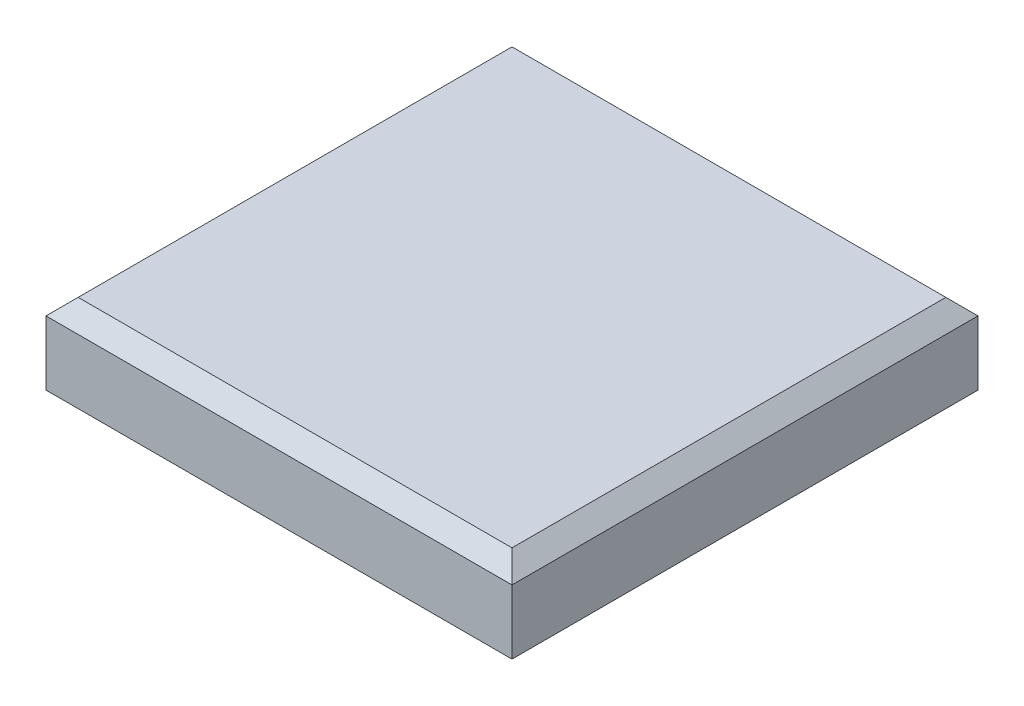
ISO-10303-21;
HEADER;
FILE_DESCRIPTION(('STEP AP214'),'2;1');
FILE_NAME('part.step','',(''),(''),'','','');
FILE_SCHEMA(('AUTOMOTIVE_DESIGN { 1 0 10303 214 1 1 1 1 }'));
ENDSEC;
DATA;
#1=APPLICATION_CONTEXT('core data for automotive mechanical design processes');
#2=APPLICATION_PROTOCOL_DEFINITION('international standard','automotive_design',2000,#1);
#3=PRODUCT_CONTEXT('',#1,'mechanical');
#4=PRODUCT('Part','Part','',(#3));
#5=PRODUCT_RELATED_PRODUCT_CATEGORY('part','',(#4));
#6=PRODUCT_DEFINITION_FORMATION('','',#4);
#7=PRODUCT_DEFINITION_CONTEXT('part definition',#1,'design');
#8=PRODUCT_DEFINITION('design','',#6,#7);
#9=PRODUCT_DEFINITION_SHAPE('','',#8);
#10=(LENGTH_UNIT() NAMED_UNIT(*) SI_UNIT(.MILLI.,.METRE.));
#11=(NAMED_UNIT(*) PLANE_ANGLE_UNIT() SI_UNIT($,.RADIAN.));
#12=(NAMED_UNIT(*) SI_UNIT($,.STERADIAN.) SOLID_ANGLE_UNIT());
#13=UNCERTAINTY_MEASURE_WITH_UNIT(LENGTH_MEASURE(1.E-05),#10,'distance_accuracy_value','');
#14=(GEOMETRIC_REPRESENTATION_CONTEXT(3) GLOBAL_UNCERTAINTY_ASSIGNED_CONTEXT((#13)) GLOBAL_UNIT_ASSIGNED_CONTEXT((#10,
#11,#12)) REPRESENTATION_CONTEXT('',''));
#15=CARTESIAN_POINT('',(0.,0.,0.));
#16=DIRECTION('',(0.,0.,1.));
#17=DIRECTION('',(1.,0.,0.));
#18=AXIS2_PLACEMENT_3D('',#15,#16,#17);
#19=CARTESIAN_POINT('',(-145.,50.,-290.));
#20=DIRECTION('',(1.,0.,0.));
#21=DIRECTION('',(0.,0.,-1.));
#22=AXIS2_PLACEMENT_3D('',#19,#20,#21);
#23=PLANE('',#22);
#24=DIRECTION('',(0.,-1.,0.));
#25=VECTOR('',#24,1.);
#26=CARTESIAN_POINT('',(-145.,50.,0.));
#27=LINE('',#26,#25);
#28=CARTESIAN_POINT('',(-145.,40.,0.));
#29=VERTEX_POINT('',#28);
#30=CARTESIAN_POINT('',(-145.,0.,0.));
#31=VERTEX_POINT('',#30);
#32=EDGE_CURVE('E86',#29,#31,#27,.T.);
#33=ORIENTED_EDGE('',*,*,#32,.F.);
#34=DIRECTION('',(0.,0.,-1.));
#35=VECTOR('',#34,1.);
#36=CARTESIAN_POINT('',(-145.,40.,-290.));
#37=LINE('',#36,#35);
#38=CARTESIAN_POINT('',(-145.,40.,-290.));
#39=VERTEX_POINT('',#38);
#40=EDGE_CURVE('E11',#29,#39,#37,.T.);
#41=ORIENTED_EDGE('',*,*,#40,.T.);
#42=DIRECTION('',(0.,-1.,0.));
#43=VECTOR('',#42,1.);
#44=CARTESIAN_POINT('',(-145.,50.,-290.));
#45=LINE('',#44,#43);
#46=CARTESIAN_POINT('',(-145.,0.,-290.));
#47=VERTEX_POINT('',#46);
#48=EDGE_CURVE('E106',#39,#47,#45,.T.);
#49=ORIENTED_EDGE('',*,*,#48,.T.);
#50=DIRECTION('',(0.,0.,1.));
#51=VECTOR('',#50,1.);
#52=CARTESIAN_POINT('',(-145.,0.,-290.));
#53=LINE('',#52,#51);
#54=EDGE_CURVE('E102',#47,#31,#53,.T.);
#55=ORIENTED_EDGE('',*,*,#54,.T.);
#56=EDGE_LOOP('',(#33,#41,#49,#55));
#57=FACE_BOUND('',#56,.T.);
#58=ADVANCED_FACE('F33',(#57),#23,.F.);
#59=CARTESIAN_POINT('',(-145.,50.,0.));
#60=DIRECTION('',(0.,0.,-1.));
#61=DIRECTION('',(-1.,0.,0.));
#62=AXIS2_PLACEMENT_3D('',#59,#60,#61);
#63=PLANE('',#62);
#64=DIRECTION('',(0.,-1.,0.));
#65=VECTOR('',#64,1.);
#66=CARTESIAN_POINT('',(145.,50.,0.));
#67=LINE('',#66,#65);
#68=CARTESIAN_POINT('',(145.,40.,0.));
#69=VERTEX_POINT('',#68);
#70=CARTESIAN_POINT('',(145.,0.,0.));
#71=VERTEX_POINT('',#70);
#72=EDGE_CURVE('E96',#69,#71,#67,.T.);
#73=ORIENTED_EDGE('',*,*,#72,.F.);
#74=DIRECTION('',(-1.,0.,0.));
#75=VECTOR('',#74,1.);
#76=CARTESIAN_POINT('',(-145.,40.,0.));
#77=LINE('',#76,#75);
#78=EDGE_CURVE('E93',#69,#29,#77,.T.);
#79=ORIENTED_EDGE('',*,*,#78,.T.);
#80=ORIENTED_EDGE('',*,*,#32,.T.);
#81=DIRECTION('',(1.,0.,0.));
#82=VECTOR('',#81,1.);
#83=CARTESIAN_POINT('',(-145.,0.,0.));
#84=LINE('',#83,#82);
#85=EDGE_CURVE('E90',#31,#71,#84,.T.);
#86=ORIENTED_EDGE('',*,*,#85,.T.);
#87=EDGE_LOOP('',(#73,#79,#80,#86));
#88=FACE_BOUND('',#87,.T.);
#89=ADVANCED_FACE('F89',(#88),#63,.F.);
#90=CARTESIAN_POINT('',(145.,50.,-290.));
#91=DIRECTION('',(-1.,0.,0.));
#92=DIRECTION('',(0.,0.,1.));
#93=AXIS2_PLACEMENT_3D('',#90,#91,#92);
#94=PLANE('',#93);
#95=DIRECTION('',(0.,-1.,0.));
#96=VECTOR('',#95,1.);
#97=CARTESIAN_POINT('',(145.,50.,-290.));
#98=LINE('',#97,#96);
#99=CARTESIAN_POINT('',(145.,40.,-290.));
#100=VERTEX_POINT('',#99);
#101=CARTESIAN_POINT('',(145.,0.,-290.));
#102=VERTEX_POINT('',#101);
#103=EDGE_CURVE('E116',#100,#102,#98,.T.);
#104=ORIENTED_EDGE('',*,*,#103,.F.);
#105=DIRECTION('',(0.,0.,1.));
#106=VECTOR('',#105,1.);
#107=CARTESIAN_POINT('',(145.,40.,0.));
#108=LINE('',#107,#106);
#109=EDGE_CURVE('E128',#100,#69,#108,.T.);
#110=ORIENTED_EDGE('',*,*,#109,.T.);
#111=ORIENTED_EDGE('',*,*,#72,.T.);
#112=DIRECTION('',(0.,0.,-1.));
#113=VECTOR('',#112,1.);
#114=CARTESIAN_POINT('',(145.,0.,-290.));
#115=LINE('',#114,#113);
#116=EDGE_CURVE('E104',#71,#102,#115,.T.);
#117=ORIENTED_EDGE('',*,*,#116,.T.);
#118=EDGE_LOOP('',(#104,#110,#111,#117));
#119=FACE_BOUND('',#118,.T.);
#120=ADVANCED_FACE('F164',(#119),#94,.F.);
#121=CARTESIAN_POINT('',(-145.,50.,-290.));
#122=DIRECTION('',(0.,0.,1.));
#123=DIRECTION('',(1.,0.,0.));
#124=AXIS2_PLACEMENT_3D('',#121,#122,#123);
#125=PLANE('',#124);
#126=ORIENTED_EDGE('',*,*,#48,.F.);
#127=DIRECTION('',(1.,0.,0.));
#128=VECTOR('',#127,1.);
#129=CARTESIAN_POINT('',(145.,40.,-290.));
#130=LINE('',#129,#128);
#131=EDGE_CURVE('E42',#39,#100,#130,.T.);
#132=ORIENTED_EDGE('',*,*,#131,.T.);
#133=ORIENTED_EDGE('',*,*,#103,.T.);
#134=DIRECTION('',(-1.,0.,0.));
#135=VECTOR('',#134,1.);
#136=CARTESIAN_POINT('',(-145.,0.,-290.));
#137=LINE('',#136,#135);
#138=EDGE_CURVE('E113',#102,#47,#137,.T.);
#139=ORIENTED_EDGE('',*,*,#138,.T.);
#140=EDGE_LOOP('',(#126,#132,#133,#139));
#141=FACE_BOUND('',#140,.T.);
#142=ADVANCED_FACE('F196',(#141),#125,.F.);
#143=CARTESIAN_POINT('',(0.,50.,0.));
#144=DIRECTION('',(0.,1.,0.));
#145=DIRECTION('',(0.,0.,1.));
#146=AXIS2_PLACEMENT_3D('',#143,#144,#145);
#147=PLANE('',#146);
#148=DIRECTION('',(0.,0.,1.));
#149=VECTOR('',#148,1.);
#150=CARTESIAN_POINT('',(-135.,50.,0.));
#151=LINE('',#150,#149);
#152=CARTESIAN_POINT('',(-135.,50.,-280.));
#153=VERTEX_POINT('',#152);
#154=CARTESIAN_POINT('',(-135.,50.,-9.99999999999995));
#155=VERTEX_POINT('',#154);
#156=EDGE_CURVE('E95',#153,#155,#151,.T.);
#157=ORIENTED_EDGE('',*,*,#156,.T.);
#158=DIRECTION('',(1.,0.,0.));
#159=VECTOR('',#158,1.);
#160=CARTESIAN_POINT('',(145.,50.,-9.99999999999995));
#161=LINE('',#160,#159);
#162=CARTESIAN_POINT('',(135.,50.,-9.99999999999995));
#163=VERTEX_POINT('',#162);
#164=EDGE_CURVE('E124',#155,#163,#161,.T.);
#165=ORIENTED_EDGE('',*,*,#164,.T.);
#166=DIRECTION('',(0.,0.,-1.));
#167=VECTOR('',#166,1.);
#168=CARTESIAN_POINT('',(135.,50.,-290.));
#169=LINE('',#168,#167);
#170=CARTESIAN_POINT('',(135.,50.,-280.));
#171=VERTEX_POINT('',#170);
#172=EDGE_CURVE('E122',#163,#171,#169,.T.);
#173=ORIENTED_EDGE('',*,*,#172,.T.);
#174=DIRECTION('',(-1.,0.,0.));
#175=VECTOR('',#174,1.);
#176=CARTESIAN_POINT('',(-145.,50.,-280.));
#177=LINE('',#176,#175);
#178=EDGE_CURVE('E120',#171,#153,#177,.T.);
#179=ORIENTED_EDGE('',*,*,#178,.T.);
#180=EDGE_LOOP('',(#157,#165,#173,#179));
#181=FACE_BOUND('',#180,.T.);
#182=ADVANCED_FACE('F146',(#181),#147,.T.);
#183=CARTESIAN_POINT('',(0.,0.,0.));
#184=DIRECTION('',(0.,1.,0.));
#185=DIRECTION('',(0.,0.,1.));
#186=AXIS2_PLACEMENT_3D('',#183,#184,#185);
#187=PLANE('',#186);
#188=ORIENTED_EDGE('',*,*,#54,.F.);
#189=ORIENTED_EDGE('',*,*,#138,.F.);
#190=ORIENTED_EDGE('',*,*,#116,.F.);
#191=ORIENTED_EDGE('',*,*,#85,.F.);
#192=EDGE_LOOP('',(#188,#189,#190,#191));
#193=FACE_BOUND('',#192,.T.);
#194=ADVANCED_FACE('F100',(#193),#187,.F.);
#195=CARTESIAN_POINT('',(0.,50.,-280.));
#196=DIRECTION('',(0.,0.707106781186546,-0.707106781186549));
#197=DIRECTION('',(1.,0.,0.));
#198=AXIS2_PLACEMENT_3D('',#195,#196,#197);
#199=PLANE('',#198);
#200=DIRECTION('',(0.577350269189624,-0.577350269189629,-0.577350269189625));
#201=VECTOR('',#200,1.);
#202=CARTESIAN_POINT('',(90.0000000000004,95.0000000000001,-235.));
#203=LINE('',#202,#201);
#204=EDGE_CURVE('E110',#100,#171,#203,.F.);
#205=ORIENTED_EDGE('',*,*,#204,.F.);
#206=ORIENTED_EDGE('',*,*,#131,.F.);
#207=DIRECTION('',(-0.577350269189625,-0.577350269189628,-0.577350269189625));
#208=VECTOR('',#207,1.);
#209=CARTESIAN_POINT('',(-41.6666666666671,143.333333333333,-186.666666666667));
#210=LINE('',#209,#208);
#211=EDGE_CURVE('E37',#153,#39,#210,.T.);
#212=ORIENTED_EDGE('',*,*,#211,.F.);
#213=ORIENTED_EDGE('',*,*,#178,.F.);
#214=EDGE_LOOP('',(#205,#206,#212,#213));
#215=FACE_BOUND('',#214,.T.);
#216=ADVANCED_FACE('F35',(#215),#199,.T.);
#217=CARTESIAN_POINT('',(-135.,50.,0.));
#218=DIRECTION('',(-0.707106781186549,0.707106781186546,0.));
#219=DIRECTION('',(0.,0.,-1.));
#220=AXIS2_PLACEMENT_3D('',#217,#218,#219);
#221=PLANE('',#220);
#222=ORIENTED_EDGE('',*,*,#211,.T.);
#223=ORIENTED_EDGE('',*,*,#40,.F.);
#224=DIRECTION('',(0.577350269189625,0.577350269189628,-0.577350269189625));
#225=VECTOR('',#224,1.);
#226=CARTESIAN_POINT('',(-138.333333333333,46.6666666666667,-6.66666666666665));
#227=LINE('',#226,#225);
#228=EDGE_CURVE('E133',#155,#29,#227,.F.);
#229=ORIENTED_EDGE('',*,*,#228,.F.);
#230=ORIENTED_EDGE('',*,*,#156,.F.);
#231=EDGE_LOOP('',(#222,#223,#229,#230));
#232=FACE_BOUND('',#231,.T.);
#233=ADVANCED_FACE('F152',(#232),#221,.T.);
#234=CARTESIAN_POINT('',(135.,50.,0.));
#235=DIRECTION('',(0.70710678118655,0.707106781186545,0.));
#236=DIRECTION('',(0.,0.,1.));
#237=AXIS2_PLACEMENT_3D('',#234,#235,#236);
#238=PLANE('',#237);
#239=ORIENTED_EDGE('',*,*,#204,.T.);
#240=ORIENTED_EDGE('',*,*,#172,.F.);
#241=DIRECTION('',(0.577350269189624,-0.577350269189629,0.577350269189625));
#242=VECTOR('',#241,1.);
#243=CARTESIAN_POINT('',(138.333333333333,46.6666666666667,-6.66666666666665));
#244=LINE('',#243,#242);
#245=EDGE_CURVE('E131',#69,#163,#244,.F.);
#246=ORIENTED_EDGE('',*,*,#245,.F.);
#247=ORIENTED_EDGE('',*,*,#109,.F.);
#248=EDGE_LOOP('',(#239,#240,#246,#247));
#249=FACE_BOUND('',#248,.T.);
#250=ADVANCED_FACE('F139',(#249),#238,.T.);
#251=CARTESIAN_POINT('',(0.,50.,-9.99999999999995));
#252=DIRECTION('',(0.,0.707106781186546,0.707106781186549));
#253=DIRECTION('',(-1.,0.,0.));
#254=AXIS2_PLACEMENT_3D('',#251,#252,#253);
#255=PLANE('',#254);
#256=ORIENTED_EDGE('',*,*,#228,.T.);
#257=ORIENTED_EDGE('',*,*,#78,.F.);
#258=ORIENTED_EDGE('',*,*,#245,.T.);
#259=ORIENTED_EDGE('',*,*,#164,.F.);
#260=EDGE_LOOP('',(#256,#257,#258,#259));
#261=FACE_BOUND('',#260,.T.);
#262=ADVANCED_FACE('F150',(#261),#255,.T.);
#263=CLOSED_SHELL('',(#58,#89,#120,#142,#182,#194,#216,#233,#250,#262));
#264=MANIFOLD_SOLID_BREP('B2',#263);
#265=ADVANCED_BREP_SHAPE_REPRESENTATION('',(#18,#264),#14);
#266=SHAPE_DEFINITION_REPRESENTATION(#9,#265);
ENDSEC;
END-ISO-10303-21;
